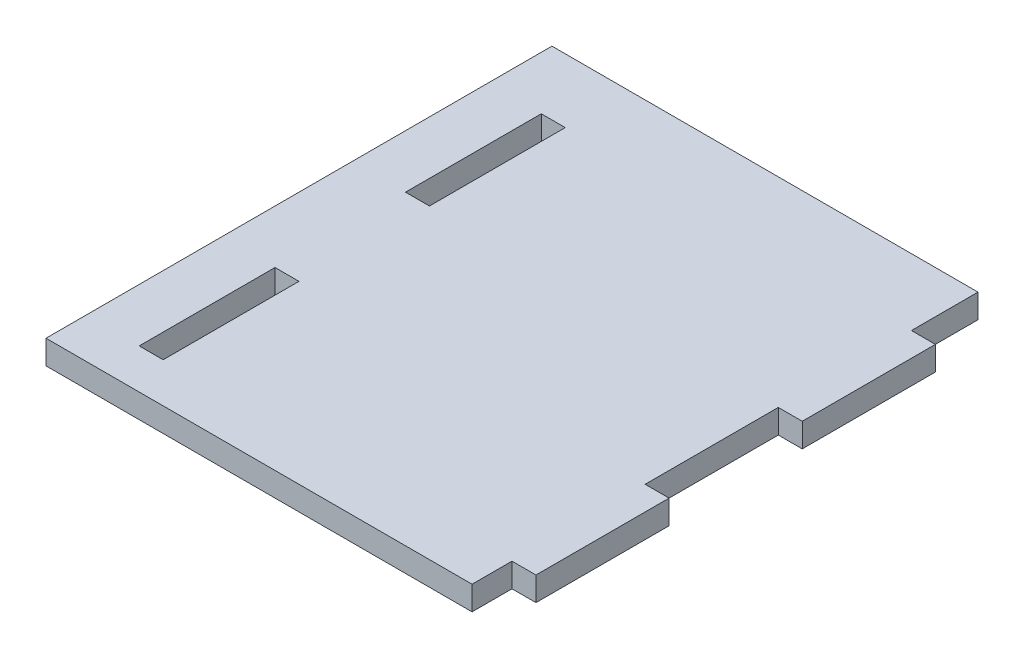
from build123d import *

# Parameters (mm, degrees)
BOSS_EXTRUDE1_DEPTH = 9
SKETCH2_W           = 9
SKETCH2_H           = 51
CUT_EXTRUDE3_DEPTH  = 172.409078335
LPATTERN2_COUNT     = 2
LPATTERN2_PITCH     = 100


with BuildPart() as part:
    # Sketch1 → Boss-Extrude1 (new body)
    with BuildSketch(Plane(origin=(0, 0, 0), x_dir=(1, 0, 0), z_dir=(0, 1, 0))):
        Polygon((109.263086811, -51.250598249), (118.263086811, -51.250598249), (118.263086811, -1.250598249), (109.263086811, -1.250598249), (109.263086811, 48.749401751), (118.263086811, 48.749401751), (118.263086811, 98.749401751), (109.263086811, 98.749401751), (109.263086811, 123.749401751), (-50.736913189, 123.749401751), (-50.736913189, -66.250598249), (109.263086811, -66.250598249), align=None)
    extrude(amount=BOSS_EXTRUDE1_DEPTH)

    # Sketch2 → Cut-Extrude3 (cut, through all)
    with BuildSketch(Plane(origin=(0, 0, 0), x_dir=(1, 0, 0), z_dir=(0, 1, 0))):
        with Locations((-26.236913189, -25.750598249)):
            Rectangle(SKETCH2_W, SKETCH2_H)
    cut_extrude3 = extrude(amount=CUT_EXTRUDE3_DEPTH, mode=Mode.SUBTRACT)

    # LPattern2: Cut-Extrude3 ×2
    with Locations(*[(0, 0, -i * LPATTERN2_PITCH) for i in range(1, LPATTERN2_COUNT)]):
        add(cut_extrude3, mode=Mode.SUBTRACT)


solid = part.part
